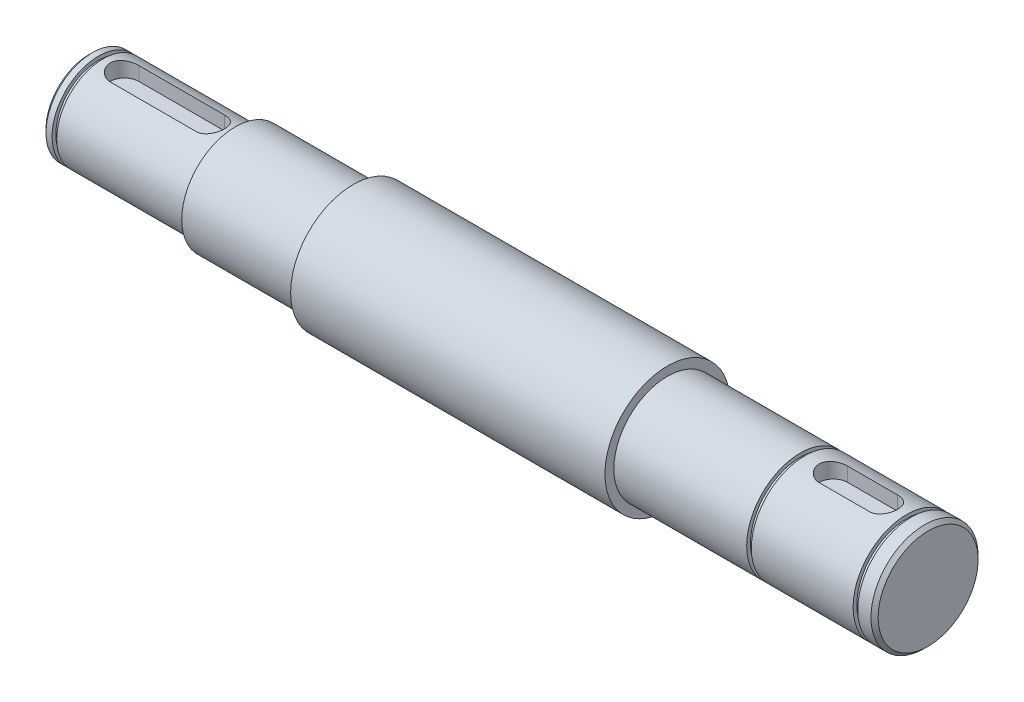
from build123d import *

# Parameters (mm, degrees)
SCHNITT_LINEAR_AUSTRAGEN1_DEPTH = 4.5
SCHNITT_LINEAR_AUSTRAGEN2_DEPTH = 4.5
FASE1_SIZE                      = 1


with BuildPart() as part:
    # Skizze1 → Rotation1 (revolve)
    with BuildSketch(Plane.XY, mode=Mode.PRIVATE) as rotation1_sk:
        Polygon((0, 0), (0, 13), (2.7, 13), (2.7, 11.95), (4, 11.95), (4, 13), (41, 13), (41, 15), (74, 15), (74, 17.5), (162, 17.5), (162, 15), (199.2, 15), (199.2, 13.95), (200.5, 13.95), (200.5, 15), (229, 15), (229, 13.95), (230.3, 13.95), (230.3, 15), (235, 15), (235, 0), align=None)
    revolve(rotation1_sk.sketch.rotate(Axis((0, 0, 0), (1, 0, 0)), 90), axis=Axis((0, 0, 0), (1, 0, 0)))

    # Skizze2 → Schnitt-Linear austragen1 (cut)
    with BuildSketch(Plane(origin=(0, 13, 0), x_dir=(1, 0, 0), z_dir=(0, 1, 0))):
        with BuildLine():
            Line((10, 4), (34, 4))
            ThreePointArc((34, 4), (38, 0), (34, -4))
            Line((34, -4), (10, -4))
            ThreePointArc((10, -4), (6, 0), (10, 4))
        make_face()
    extrude(amount=-SCHNITT_LINEAR_AUSTRAGEN1_DEPTH, mode=Mode.SUBTRACT)

    # Skizze3 → Schnitt-Linear austragen2 (cut)
    with BuildSketch(Plane(origin=(0, 15, 0), x_dir=(1, 0, 0), z_dir=(0, 1, 0))):
        with BuildLine():
            Line((208.5, 4), (222.5, 4))
            ThreePointArc((222.5, 4), (226.5, 0), (222.5, -4))
            Line((222.5, -4), (208.5, -4))
            ThreePointArc((208.5, -4), (204.5, 0), (208.5, 4))
        make_face()
    extrude(amount=-SCHNITT_LINEAR_AUSTRAGEN2_DEPTH, mode=Mode.SUBTRACT)

    # Fase1
    fase1_edges = [part.edges().sort_by_distance(p)[0] for p in [
        (235, 0, -15),
        (0, 0, -13),
    ]]
    chamfer(fase1_edges, length=FASE1_SIZE)


solid = part.part
